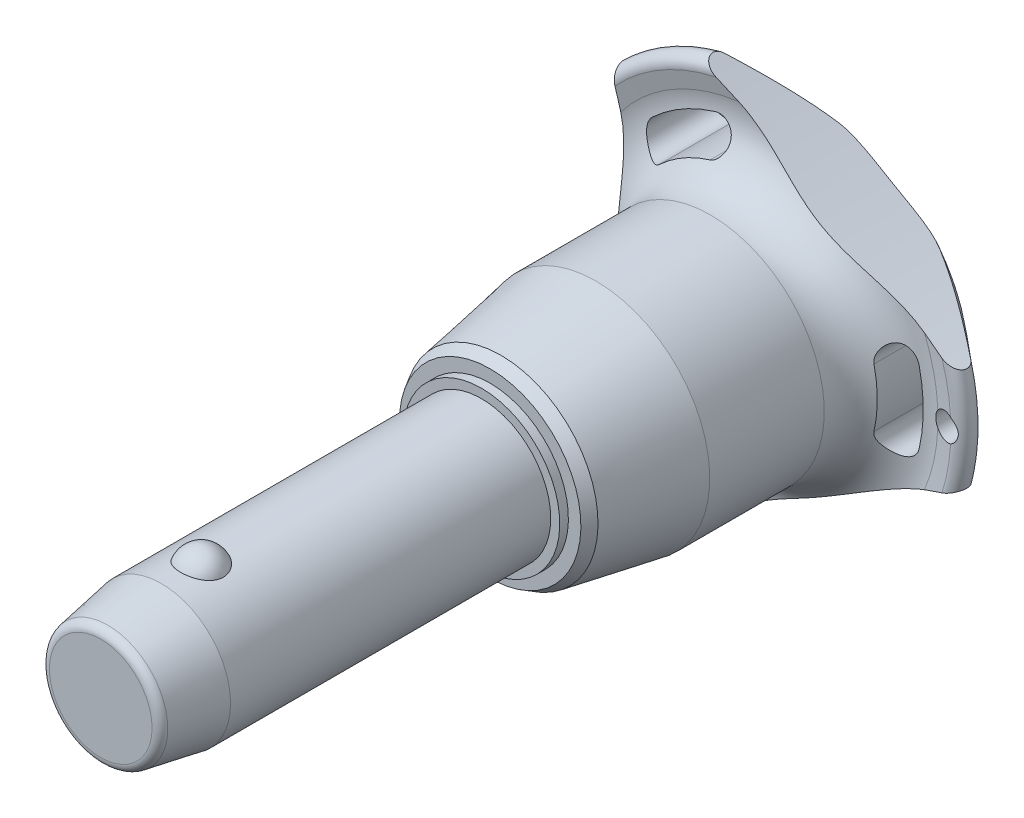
from build123d import *

# Parameters (mm, degrees)
SKETCH1_R           = 8
BOSS_EXTRUDE1_DEPTH = 30
SKETCH2_R           = 7
BOSS_EXTRUDE2_DEPTH = 39.7
BOSS_EXTRUDE3_START = 14
SKETCH1_2_R         = 8
BOSS_EXTRUDE3_DEPTH = 14
CHAMFER1_SIZE       = 7
CHAMFER1_SIZE2      = 1.234288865
FILLET1_R           = 1
SKETCH6_R           = 144.275
CUT_EXTRUDE1_DEPTH  = 78.404041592
CIRPATTERN1_COUNT   = 3
SKETCH7_R           = 1.5
CUT_EXTRUDE2_DEPTH  = 78.144330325


with BuildPart() as part:
    # Sketch1 → Boss-Extrude1 (new body)
    with BuildSketch(Plane.XY):
        Circle(SKETCH1_R)
    extrude(amount=-BOSS_EXTRUDE1_DEPTH)

    # Sketch2 → Boss-Extrude2 (add)
    with BuildSketch(Plane(origin=(0, 0, -30), x_dir=(-1, 0, 0), z_dir=(0, 0, -1))):
        Circle(SKETCH2_R)
    extrude(amount=BOSS_EXTRUDE2_DEPTH)

    # Sketch3 → Revolve1 (revolve)
    with BuildSketch(Plane(origin=(0, 0, 0), x_dir=(0, 0, -1), z_dir=(1, 0, 0))):
        with BuildLine():
            Line((-2.387467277, 9.5), (-2.387467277, 4.2))
            ThreePointArc((-2.387467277, 4.2), (0.262532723, 6.85), (-2.387467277, 9.5))
        make_face()
        with BuildLine():
            Line((-2.387467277, -4.2), (-2.387467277, -9.5))
            ThreePointArc((-2.387467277, -9.5), (0.262532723, -6.85), (-2.387467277, -4.2))
        make_face()
    revolve(axis=Axis((0, -4.2, 2.387467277), (0, 1, 0)))

    # Sketch1_2 → Boss-Extrude3 (add)
    with BuildSketch(Plane.XY.offset(BOSS_EXTRUDE3_START)):
        Circle(SKETCH1_2_R)
    extrude(amount=-BOSS_EXTRUDE3_DEPTH)

    # Chamfer1
    chamfer1_edges = [part.edges().sort_by_distance(p)[0] for p in [
        (-8, 0, 14),
    ]]
    chamfer1_side = [part.faces().sort_by_distance(p)[0] for p in [
        (-8, 0, -8),
    ]]
    chamfer(chamfer1_edges, length=CHAMFER1_SIZE, length2=CHAMFER1_SIZE2, reference=chamfer1_side[0])

    # Fillet1
    fillet1_edges = [part.edges().sort_by_distance(p)[0] for p in [
        (-6.765711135, 0, 14),
        (7, 0, -69.7),
    ]]
    fillet(fillet1_edges, radius=FILLET1_R)

    # Sketch4 → Revolve2 (revolve)
    with BuildSketch(Plane(origin=(0, 0, 0), x_dir=(0, 0, -1), z_dir=(1, 0, 0))):
        Polygon((30, 0), (30, 9.044607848), (31, 9.044607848), (31, 10.490707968), (32.25235944, 11.213758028), (43.233333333, 13.15), (56.466666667, 13.15), (56.466666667, 0), align=None)
    revolve(axis=Axis((0, 0, -56.466666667), (0, 0, 1)))

    # Sketch5 → Revolve3 (revolve)
    with BuildSketch(Plane(origin=(0, 0, 0), x_dir=(0, 0, -1), z_dir=(1, 0, 0)), mode=Mode.PRIVATE) as revolve3_sk:
        with BuildLine():
            Line((62.32877039, 20.428960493), (61.910912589, 22.344207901))
            ThreePointArc((61.910912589, 22.344207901), (62.554394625, 23.677136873), (64.002586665, 23.371345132))
            Line((64.002586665, 23.371345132), (69.141488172, 17.247040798))
            ThreePointArc((69.141488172, 17.247040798), (69.7, 15.584758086), (68.978803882, 13.986322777))
            ThreePointArc((68.978803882, 13.986322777), (64.617427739, 7.589034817), (63.083333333, 0))
            Line((63.083333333, 0), (56.466666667, 0))
            Line((56.466666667, 0), (56.466666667, 13.15))
            ThreePointArc((56.466666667, 13.15), (61.139661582, 15.38660811), (62.32877039, 20.428960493))
        make_face()
    revolve(revolve3_sk.sketch.rotate(Axis((0, 0, -63.083333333), (0, 0, 1)), 90), axis=Axis((0, 0, -63.083333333), (0, 0, 1)))

    # Sketch6 → Cut-Extrude1 (cut, through all)
    with BuildSketch(Plane.XY):
        with Locations((-159.975, 0)):
            Circle(SKETCH6_R)
        with BuildLine():
            ThreePointArc((18.131206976, -4.190753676), (18.60922037, 0), (18.131206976, 4.190753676))
            ThreePointArc((18.131206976, 4.190753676), (15.94840906, 5.553949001), (14.585213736, 3.371151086))
            ThreePointArc((14.585213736, 3.371151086), (14.969740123, 0), (14.585213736, -3.371151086))
            ThreePointArc((14.585213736, -3.371151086), (15.94840906, -5.553949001), (18.131206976, -4.190753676))
        make_face()
    cut_extrude1 = extrude(amount=-CUT_EXTRUDE1_DEPTH, mode=Mode.SUBTRACT)

    # CirPattern1: Cut-Extrude1 ×3 about axis
    cirpattern1_axis = Axis((0, 0, 0), (0, 0, 1))
    for i in range(1, CIRPATTERN1_COUNT):
        add(cut_extrude1.rotate(cirpattern1_axis, i * 360 / CIRPATTERN1_COUNT), mode=Mode.SUBTRACT)

    # Sketch7 → Cut-Extrude2 (cut, through all)
    with BuildSketch(Plane.XY):
        with Locations(Location((21.60922037, 0, 0), (0, 0, 297.620773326))):
            Circle(SKETCH7_R)
    extrude(amount=-CUT_EXTRUDE2_DEPTH, mode=Mode.SUBTRACT)


solid = part.part
